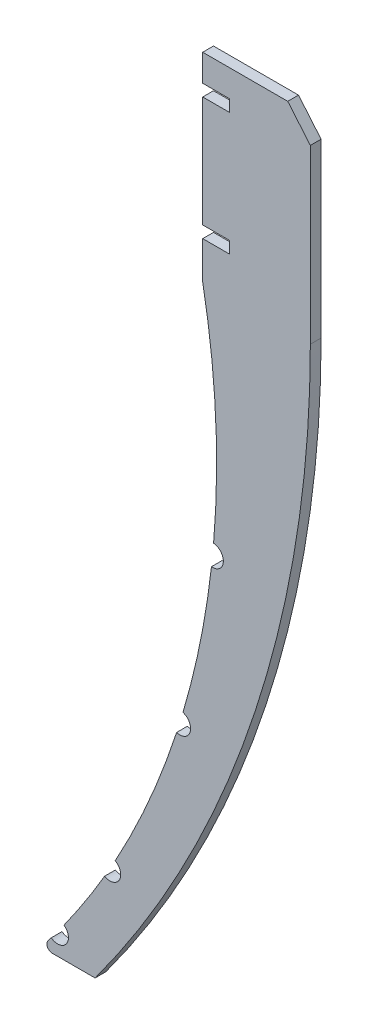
ISO-10303-21;
HEADER;
FILE_DESCRIPTION(('STEP AP214'),'2;1');
FILE_NAME('part.step','',(''),(''),'','','');
FILE_SCHEMA(('AUTOMOTIVE_DESIGN { 1 0 10303 214 1 1 1 1 }'));
ENDSEC;
DATA;
#1=APPLICATION_CONTEXT('core data for automotive mechanical design processes');
#2=APPLICATION_PROTOCOL_DEFINITION('international standard','automotive_design',2000,#1);
#3=PRODUCT_CONTEXT('',#1,'mechanical');
#4=PRODUCT('Part','Part','',(#3));
#5=PRODUCT_RELATED_PRODUCT_CATEGORY('part','',(#4));
#6=PRODUCT_DEFINITION_FORMATION('','',#4);
#7=PRODUCT_DEFINITION_CONTEXT('part definition',#1,'design');
#8=PRODUCT_DEFINITION('design','',#6,#7);
#9=PRODUCT_DEFINITION_SHAPE('','',#8);
#10=(LENGTH_UNIT() NAMED_UNIT(*) SI_UNIT(.MILLI.,.METRE.));
#11=(NAMED_UNIT(*) PLANE_ANGLE_UNIT() SI_UNIT($,.RADIAN.));
#12=(NAMED_UNIT(*) SI_UNIT($,.STERADIAN.) SOLID_ANGLE_UNIT());
#13=UNCERTAINTY_MEASURE_WITH_UNIT(LENGTH_MEASURE(1.E-05),#10,'distance_accuracy_value','');
#14=(GEOMETRIC_REPRESENTATION_CONTEXT(3) GLOBAL_UNCERTAINTY_ASSIGNED_CONTEXT((#13)) GLOBAL_UNIT_ASSIGNED_CONTEXT((#10,
#11,#12)) REPRESENTATION_CONTEXT('',''));
#15=CARTESIAN_POINT('',(0.,0.,0.));
#16=DIRECTION('',(0.,0.,1.));
#17=DIRECTION('',(1.,0.,0.));
#18=AXIS2_PLACEMENT_3D('',#15,#16,#17);
#19=CARTESIAN_POINT('',(-19.9999999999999,-156.8,1.5));
#20=DIRECTION('',(0.,1.,0.));
#21=DIRECTION('',(1.,0.,0.));
#22=AXIS2_PLACEMENT_3D('',#19,#20,#21);
#23=PLANE('',#22);
#24=DIRECTION('',(0.,0.,1.));
#25=VECTOR('',#24,1.);
#26=CARTESIAN_POINT('',(-27.9577727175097,-156.8,1.5));
#27=LINE('',#26,#25);
#28=CARTESIAN_POINT('',(-27.9577727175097,-156.8,-0.5));
#29=VERTEX_POINT('',#28);
#30=CARTESIAN_POINT('',(-27.9577727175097,-156.8,1.5));
#31=VERTEX_POINT('',#30);
#32=EDGE_CURVE('E11',#29,#31,#27,.T.);
#33=ORIENTED_EDGE('',*,*,#32,.F.);
#34=DIRECTION('',(-1.,0.,0.));
#35=VECTOR('',#34,1.);
#36=CARTESIAN_POINT('',(-186.05,-156.8,-0.5));
#37=LINE('',#36,#35);
#38=CARTESIAN_POINT('',(-19.9999999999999,-156.8,-0.5));
#39=VERTEX_POINT('',#38);
#40=EDGE_CURVE('E149',#29,#39,#37,.F.);
#41=ORIENTED_EDGE('',*,*,#40,.T.);
#42=DIRECTION('',(0.,0.,1.));
#43=VECTOR('',#42,1.);
#44=CARTESIAN_POINT('',(-19.9999999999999,-156.8,1.5));
#45=LINE('',#44,#43);
#46=CARTESIAN_POINT('',(-19.9999999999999,-156.8,1.5));
#47=VERTEX_POINT('',#46);
#48=EDGE_CURVE('E44',#39,#47,#45,.T.);
#49=ORIENTED_EDGE('',*,*,#48,.T.);
#50=DIRECTION('',(1.,0.,0.));
#51=VECTOR('',#50,1.);
#52=CARTESIAN_POINT('',(-19.9999999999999,-156.8,1.5));
#53=LINE('',#52,#51);
#54=EDGE_CURVE('E284',#31,#47,#53,.T.);
#55=ORIENTED_EDGE('',*,*,#54,.F.);
#56=EDGE_LOOP('',(#33,#41,#49,#55));
#57=FACE_BOUND('',#56,.T.);
#58=ADVANCED_FACE('F34',(#57),#23,.F.);
#59=CARTESIAN_POINT('',(-186.05,-34.8000000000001,1.5));
#60=DIRECTION('',(0.,0.,1.));
#61=DIRECTION('',(1.,0.,0.));
#62=AXIS2_PLACEMENT_3D('',#59,#60,#61);
#63=CYLINDRICAL_SURFACE('',#62,206.05);
#64=ORIENTED_EDGE('',*,*,#48,.F.);
#65=CARTESIAN_POINT('',(-186.05,-34.8000000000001,-0.5));
#66=DIRECTION('',(0.,0.,1.));
#67=DIRECTION('',(1.,0.,0.));
#68=AXIS2_PLACEMENT_3D('',#65,#66,#67);
#69=CIRCLE('',#68,206.05);
#70=CARTESIAN_POINT('',(20.,-34.8,-0.5));
#71=VERTEX_POINT('',#70);
#72=EDGE_CURVE('E216',#39,#71,#69,.T.);
#73=ORIENTED_EDGE('',*,*,#72,.T.);
#74=DIRECTION('',(0.,0.,1.));
#75=VECTOR('',#74,1.);
#76=CARTESIAN_POINT('',(20.,-34.8,1.5));
#77=LINE('',#76,#75);
#78=CARTESIAN_POINT('',(20.,-34.8,1.5));
#79=VERTEX_POINT('',#78);
#80=EDGE_CURVE('E277',#71,#79,#77,.T.);
#81=ORIENTED_EDGE('',*,*,#80,.T.);
#82=CARTESIAN_POINT('',(-186.05,-34.8000000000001,1.5));
#83=DIRECTION('',(0.,0.,1.));
#84=DIRECTION('',(-1.,0.,0.));
#85=AXIS2_PLACEMENT_3D('',#82,#83,#84);
#86=CIRCLE('',#85,206.05);
#87=EDGE_CURVE('E293',#47,#79,#86,.T.);
#88=ORIENTED_EDGE('',*,*,#87,.F.);
#89=EDGE_LOOP('',(#64,#73,#81,#88));
#90=FACE_BOUND('',#89,.T.);
#91=ADVANCED_FACE('F296',(#90),#63,.T.);
#92=CARTESIAN_POINT('',(20.,2.2,1.5));
#93=DIRECTION('',(-1.,0.,0.));
#94=DIRECTION('',(0.,1.,0.));
#95=AXIS2_PLACEMENT_3D('',#92,#93,#94);
#96=PLANE('',#95);
#97=ORIENTED_EDGE('',*,*,#80,.F.);
#98=DIRECTION('',(0.,1.,0.));
#99=VECTOR('',#98,1.);
#100=CARTESIAN_POINT('',(20.,-34.8000000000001,-0.5));
#101=LINE('',#100,#99);
#102=CARTESIAN_POINT('',(20.,-2.80000000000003,-0.5));
#103=VERTEX_POINT('',#102);
#104=EDGE_CURVE('E213',#71,#103,#101,.T.);
#105=ORIENTED_EDGE('',*,*,#104,.T.);
#106=DIRECTION('',(0.,0.,1.));
#107=VECTOR('',#106,1.);
#108=CARTESIAN_POINT('',(20.,-2.80000000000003,1.5));
#109=LINE('',#108,#107);
#110=CARTESIAN_POINT('',(20.,-2.80000000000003,1.5));
#111=VERTEX_POINT('',#110);
#112=EDGE_CURVE('E274',#103,#111,#109,.T.);
#113=ORIENTED_EDGE('',*,*,#112,.T.);
#114=DIRECTION('',(0.,1.,0.));
#115=VECTOR('',#114,1.);
#116=CARTESIAN_POINT('',(20.,2.2,1.5));
#117=LINE('',#116,#115);
#118=EDGE_CURVE('E297',#79,#111,#117,.T.);
#119=ORIENTED_EDGE('',*,*,#118,.F.);
#120=EDGE_LOOP('',(#97,#105,#113,#119));
#121=FACE_BOUND('',#120,.T.);
#122=ADVANCED_FACE('F464',(#121),#96,.F.);
#123=CARTESIAN_POINT('',(15.8045018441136,2.2,1.5));
#124=DIRECTION('',(0.76604444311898,0.642787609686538,0.));
#125=DIRECTION('',(0.642787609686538,-0.76604444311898,0.));
#126=AXIS2_PLACEMENT_3D('',#123,#124,#125);
#127=PLANE('',#126);
#128=ORIENTED_EDGE('',*,*,#112,.F.);
#129=DIRECTION('',(0.642787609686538,-0.76604444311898,0.));
#130=VECTOR('',#129,1.);
#131=CARTESIAN_POINT('',(15.8045018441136,2.2,-0.5));
#132=LINE('',#131,#130);
#133=CARTESIAN_POINT('',(15.8045018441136,2.2,-0.5));
#134=VERTEX_POINT('',#133);
#135=EDGE_CURVE('E210',#103,#134,#132,.F.);
#136=ORIENTED_EDGE('',*,*,#135,.T.);
#137=DIRECTION('',(0.,0.,1.));
#138=VECTOR('',#137,1.);
#139=CARTESIAN_POINT('',(15.8045018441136,2.2,1.5));
#140=LINE('',#139,#138);
#141=CARTESIAN_POINT('',(15.8045018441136,2.2,1.5));
#142=VERTEX_POINT('',#141);
#143=EDGE_CURVE('E271',#134,#142,#140,.T.);
#144=ORIENTED_EDGE('',*,*,#143,.T.);
#145=DIRECTION('',(0.642787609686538,-0.76604444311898,0.));
#146=VECTOR('',#145,1.);
#147=CARTESIAN_POINT('',(15.8045018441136,2.2,1.5));
#148=LINE('',#147,#146);
#149=EDGE_CURVE('E299',#111,#142,#148,.F.);
#150=ORIENTED_EDGE('',*,*,#149,.F.);
#151=EDGE_LOOP('',(#128,#136,#144,#150));
#152=FACE_BOUND('',#151,.T.);
#153=ADVANCED_FACE('F460',(#152),#127,.T.);
#154=CARTESIAN_POINT('',(0.,2.2,1.5));
#155=DIRECTION('',(0.,-1.,0.));
#156=DIRECTION('',(-1.,0.,0.));
#157=AXIS2_PLACEMENT_3D('',#154,#155,#156);
#158=PLANE('',#157);
#159=ORIENTED_EDGE('',*,*,#143,.F.);
#160=DIRECTION('',(-1.,0.,0.));
#161=VECTOR('',#160,1.);
#162=CARTESIAN_POINT('',(-186.05,2.2,-0.5));
#163=LINE('',#162,#161);
#164=CARTESIAN_POINT('',(0.,2.2,-0.5));
#165=VERTEX_POINT('',#164);
#166=EDGE_CURVE('E207',#134,#165,#163,.T.);
#167=ORIENTED_EDGE('',*,*,#166,.T.);
#168=DIRECTION('',(0.,0.,1.));
#169=VECTOR('',#168,1.);
#170=CARTESIAN_POINT('',(0.,2.2,1.5));
#171=LINE('',#170,#169);
#172=CARTESIAN_POINT('',(0.,2.2,1.5));
#173=VERTEX_POINT('',#172);
#174=EDGE_CURVE('E268',#165,#173,#171,.T.);
#175=ORIENTED_EDGE('',*,*,#174,.T.);
#176=DIRECTION('',(-1.,0.,0.));
#177=VECTOR('',#176,1.);
#178=CARTESIAN_POINT('',(0.,2.2,1.5));
#179=LINE('',#178,#177);
#180=EDGE_CURVE('E305',#142,#173,#179,.T.);
#181=ORIENTED_EDGE('',*,*,#180,.F.);
#182=EDGE_LOOP('',(#159,#167,#175,#181));
#183=FACE_BOUND('',#182,.T.);
#184=ADVANCED_FACE('F457',(#183),#158,.F.);
#185=CARTESIAN_POINT('',(0.,-2.8,1.5));
#186=DIRECTION('',(1.,0.,0.));
#187=DIRECTION('',(0.,-1.,0.));
#188=AXIS2_PLACEMENT_3D('',#185,#186,#187);
#189=PLANE('',#188);
#190=ORIENTED_EDGE('',*,*,#174,.F.);
#191=DIRECTION('',(0.,1.,0.));
#192=VECTOR('',#191,1.);
#193=CARTESIAN_POINT('',(0.,-34.8000000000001,-0.5));
#194=LINE('',#193,#192);
#195=CARTESIAN_POINT('',(0.,-2.8,-0.5));
#196=VERTEX_POINT('',#195);
#197=EDGE_CURVE('E204',#165,#196,#194,.F.);
#198=ORIENTED_EDGE('',*,*,#197,.T.);
#199=DIRECTION('',(0.,0.,1.));
#200=VECTOR('',#199,1.);
#201=CARTESIAN_POINT('',(0.,-2.8,1.5));
#202=LINE('',#201,#200);
#203=CARTESIAN_POINT('',(0.,-2.8,1.5));
#204=VERTEX_POINT('',#203);
#205=EDGE_CURVE('E265',#196,#204,#202,.T.);
#206=ORIENTED_EDGE('',*,*,#205,.T.);
#207=DIRECTION('',(0.,-1.,0.));
#208=VECTOR('',#207,1.);
#209=CARTESIAN_POINT('',(0.,-2.8,1.5));
#210=LINE('',#209,#208);
#211=EDGE_CURVE('E308',#173,#204,#210,.T.);
#212=ORIENTED_EDGE('',*,*,#211,.F.);
#213=EDGE_LOOP('',(#190,#198,#206,#212));
#214=FACE_BOUND('',#213,.T.);
#215=ADVANCED_FACE('F454',(#214),#189,.F.);
#216=CARTESIAN_POINT('',(0.,-2.8,1.5));
#217=DIRECTION('',(0.,1.,0.));
#218=DIRECTION('',(1.,0.,0.));
#219=AXIS2_PLACEMENT_3D('',#216,#217,#218);
#220=PLANE('',#219);
#221=ORIENTED_EDGE('',*,*,#205,.F.);
#222=DIRECTION('',(-1.,0.,0.));
#223=VECTOR('',#222,1.);
#224=CARTESIAN_POINT('',(-186.05,-2.8,-0.5));
#225=LINE('',#224,#223);
#226=CARTESIAN_POINT('',(5.,-2.8,-0.5));
#227=VERTEX_POINT('',#226);
#228=EDGE_CURVE('E201',#196,#227,#225,.F.);
#229=ORIENTED_EDGE('',*,*,#228,.T.);
#230=DIRECTION('',(0.,0.,1.));
#231=VECTOR('',#230,1.);
#232=CARTESIAN_POINT('',(5.,-2.8,1.5));
#233=LINE('',#232,#231);
#234=CARTESIAN_POINT('',(5.,-2.8,1.5));
#235=VERTEX_POINT('',#234);
#236=EDGE_CURVE('E262',#227,#235,#233,.T.);
#237=ORIENTED_EDGE('',*,*,#236,.T.);
#238=DIRECTION('',(1.,0.,0.));
#239=VECTOR('',#238,1.);
#240=CARTESIAN_POINT('',(0.,-2.8,1.5));
#241=LINE('',#240,#239);
#242=EDGE_CURVE('E311',#204,#235,#241,.T.);
#243=ORIENTED_EDGE('',*,*,#242,.F.);
#244=EDGE_LOOP('',(#221,#229,#237,#243));
#245=FACE_BOUND('',#244,.T.);
#246=ADVANCED_FACE('F449',(#245),#220,.F.);
#247=CARTESIAN_POINT('',(5.,-2.8,1.5));
#248=DIRECTION('',(1.,0.,0.));
#249=DIRECTION('',(0.,-1.,0.));
#250=AXIS2_PLACEMENT_3D('',#247,#248,#249);
#251=PLANE('',#250);
#252=ORIENTED_EDGE('',*,*,#236,.F.);
#253=DIRECTION('',(0.,1.,0.));
#254=VECTOR('',#253,1.);
#255=CARTESIAN_POINT('',(5.,-34.8000000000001,-0.5));
#256=LINE('',#255,#254);
#257=CARTESIAN_POINT('',(5.,-5.,-0.5));
#258=VERTEX_POINT('',#257);
#259=EDGE_CURVE('E198',#227,#258,#256,.F.);
#260=ORIENTED_EDGE('',*,*,#259,.T.);
#261=DIRECTION('',(0.,0.,1.));
#262=VECTOR('',#261,1.);
#263=CARTESIAN_POINT('',(5.,-5.,1.5));
#264=LINE('',#263,#262);
#265=CARTESIAN_POINT('',(5.,-5.,1.5));
#266=VERTEX_POINT('',#265);
#267=EDGE_CURVE('E259',#258,#266,#264,.T.);
#268=ORIENTED_EDGE('',*,*,#267,.T.);
#269=DIRECTION('',(0.,-1.,0.));
#270=VECTOR('',#269,1.);
#271=CARTESIAN_POINT('',(5.,-2.8,1.5));
#272=LINE('',#271,#270);
#273=EDGE_CURVE('E314',#235,#266,#272,.T.);
#274=ORIENTED_EDGE('',*,*,#273,.F.);
#275=EDGE_LOOP('',(#252,#260,#268,#274));
#276=FACE_BOUND('',#275,.T.);
#277=ADVANCED_FACE('F445',(#276),#251,.F.);
#278=CARTESIAN_POINT('',(0.,-5.,1.5));
#279=DIRECTION('',(0.,-1.,0.));
#280=DIRECTION('',(-1.,0.,0.));
#281=AXIS2_PLACEMENT_3D('',#278,#279,#280);
#282=PLANE('',#281);
#283=ORIENTED_EDGE('',*,*,#267,.F.);
#284=DIRECTION('',(-1.,0.,0.));
#285=VECTOR('',#284,1.);
#286=CARTESIAN_POINT('',(-186.05,-5.,-0.5));
#287=LINE('',#286,#285);
#288=CARTESIAN_POINT('',(0.,-5.,-0.5));
#289=VERTEX_POINT('',#288);
#290=EDGE_CURVE('E195',#258,#289,#287,.T.);
#291=ORIENTED_EDGE('',*,*,#290,.T.);
#292=DIRECTION('',(0.,0.,1.));
#293=VECTOR('',#292,1.);
#294=CARTESIAN_POINT('',(0.,-5.,1.5));
#295=LINE('',#294,#293);
#296=CARTESIAN_POINT('',(0.,-5.,1.5));
#297=VERTEX_POINT('',#296);
#298=EDGE_CURVE('E256',#289,#297,#295,.T.);
#299=ORIENTED_EDGE('',*,*,#298,.T.);
#300=DIRECTION('',(-1.,0.,0.));
#301=VECTOR('',#300,1.);
#302=CARTESIAN_POINT('',(0.,-5.,1.5));
#303=LINE('',#302,#301);
#304=EDGE_CURVE('E317',#266,#297,#303,.T.);
#305=ORIENTED_EDGE('',*,*,#304,.F.);
#306=EDGE_LOOP('',(#283,#291,#299,#305));
#307=FACE_BOUND('',#306,.T.);
#308=ADVANCED_FACE('F442',(#307),#282,.F.);
#309=CARTESIAN_POINT('',(0.,-5.,1.5));
#310=DIRECTION('',(1.,0.,0.));
#311=DIRECTION('',(0.,-1.,0.));
#312=AXIS2_PLACEMENT_3D('',#309,#310,#311);
#313=PLANE('',#312);
#314=ORIENTED_EDGE('',*,*,#298,.F.);
#315=DIRECTION('',(0.,1.,0.));
#316=VECTOR('',#315,1.);
#317=CARTESIAN_POINT('',(0.,-34.8000000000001,-0.5));
#318=LINE('',#317,#316);
#319=CARTESIAN_POINT('',(0.,-25.6,-0.5));
#320=VERTEX_POINT('',#319);
#321=EDGE_CURVE('E192',#289,#320,#318,.F.);
#322=ORIENTED_EDGE('',*,*,#321,.T.);
#323=DIRECTION('',(0.,0.,1.));
#324=VECTOR('',#323,1.);
#325=CARTESIAN_POINT('',(0.,-25.6,1.5));
#326=LINE('',#325,#324);
#327=CARTESIAN_POINT('',(0.,-25.6,1.5));
#328=VERTEX_POINT('',#327);
#329=EDGE_CURVE('E253',#320,#328,#326,.T.);
#330=ORIENTED_EDGE('',*,*,#329,.T.);
#331=DIRECTION('',(0.,-1.,0.));
#332=VECTOR('',#331,1.);
#333=CARTESIAN_POINT('',(0.,-5.,1.5));
#334=LINE('',#333,#332);
#335=EDGE_CURVE('E320',#297,#328,#334,.T.);
#336=ORIENTED_EDGE('',*,*,#335,.F.);
#337=EDGE_LOOP('',(#314,#322,#330,#336));
#338=FACE_BOUND('',#337,.T.);
#339=ADVANCED_FACE('F437',(#338),#313,.F.);
#340=CARTESIAN_POINT('',(0.,-25.6,1.5));
#341=DIRECTION('',(0.,1.,0.));
#342=DIRECTION('',(1.,0.,0.));
#343=AXIS2_PLACEMENT_3D('',#340,#341,#342);
#344=PLANE('',#343);
#345=ORIENTED_EDGE('',*,*,#329,.F.);
#346=DIRECTION('',(-1.,0.,0.));
#347=VECTOR('',#346,1.);
#348=CARTESIAN_POINT('',(-186.05,-25.6,-0.5));
#349=LINE('',#348,#347);
#350=CARTESIAN_POINT('',(5.,-25.6,-0.5));
#351=VERTEX_POINT('',#350);
#352=EDGE_CURVE('E189',#320,#351,#349,.F.);
#353=ORIENTED_EDGE('',*,*,#352,.T.);
#354=DIRECTION('',(0.,0.,1.));
#355=VECTOR('',#354,1.);
#356=CARTESIAN_POINT('',(5.,-25.6,1.5));
#357=LINE('',#356,#355);
#358=CARTESIAN_POINT('',(5.,-25.6,1.5));
#359=VERTEX_POINT('',#358);
#360=EDGE_CURVE('E250',#351,#359,#357,.T.);
#361=ORIENTED_EDGE('',*,*,#360,.T.);
#362=DIRECTION('',(1.,0.,0.));
#363=VECTOR('',#362,1.);
#364=CARTESIAN_POINT('',(0.,-25.6,1.5));
#365=LINE('',#364,#363);
#366=EDGE_CURVE('E323',#328,#359,#365,.T.);
#367=ORIENTED_EDGE('',*,*,#366,.F.);
#368=EDGE_LOOP('',(#345,#353,#361,#367));
#369=FACE_BOUND('',#368,.T.);
#370=ADVANCED_FACE('F433',(#369),#344,.F.);
#371=CARTESIAN_POINT('',(5.,-25.6,1.5));
#372=DIRECTION('',(1.,0.,0.));
#373=DIRECTION('',(0.,-1.,0.));
#374=AXIS2_PLACEMENT_3D('',#371,#372,#373);
#375=PLANE('',#374);
#376=ORIENTED_EDGE('',*,*,#360,.F.);
#377=DIRECTION('',(0.,1.,0.));
#378=VECTOR('',#377,1.);
#379=CARTESIAN_POINT('',(5.,-34.8000000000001,-0.5));
#380=LINE('',#379,#378);
#381=CARTESIAN_POINT('',(5.,-27.8,-0.5));
#382=VERTEX_POINT('',#381);
#383=EDGE_CURVE('E186',#351,#382,#380,.F.);
#384=ORIENTED_EDGE('',*,*,#383,.T.);
#385=DIRECTION('',(0.,0.,1.));
#386=VECTOR('',#385,1.);
#387=CARTESIAN_POINT('',(5.,-27.8,1.5));
#388=LINE('',#387,#386);
#389=CARTESIAN_POINT('',(5.,-27.8,1.5));
#390=VERTEX_POINT('',#389);
#391=EDGE_CURVE('E247',#382,#390,#388,.T.);
#392=ORIENTED_EDGE('',*,*,#391,.T.);
#393=DIRECTION('',(0.,-1.,0.));
#394=VECTOR('',#393,1.);
#395=CARTESIAN_POINT('',(5.,-25.6,1.5));
#396=LINE('',#395,#394);
#397=EDGE_CURVE('E326',#359,#390,#396,.T.);
#398=ORIENTED_EDGE('',*,*,#397,.F.);
#399=EDGE_LOOP('',(#376,#384,#392,#398));
#400=FACE_BOUND('',#399,.T.);
#401=ADVANCED_FACE('F430',(#400),#375,.F.);
#402=CARTESIAN_POINT('',(0.,-27.8,1.5));
#403=DIRECTION('',(0.,-1.,0.));
#404=DIRECTION('',(-1.,0.,0.));
#405=AXIS2_PLACEMENT_3D('',#402,#403,#404);
#406=PLANE('',#405);
#407=ORIENTED_EDGE('',*,*,#391,.F.);
#408=DIRECTION('',(-1.,0.,0.));
#409=VECTOR('',#408,1.);
#410=CARTESIAN_POINT('',(-186.05,-27.8,-0.5));
#411=LINE('',#410,#409);
#412=CARTESIAN_POINT('',(0.,-27.8,-0.5));
#413=VERTEX_POINT('',#412);
#414=EDGE_CURVE('E183',#382,#413,#411,.T.);
#415=ORIENTED_EDGE('',*,*,#414,.T.);
#416=DIRECTION('',(0.,0.,1.));
#417=VECTOR('',#416,1.);
#418=CARTESIAN_POINT('',(0.,-27.8,1.5));
#419=LINE('',#418,#417);
#420=CARTESIAN_POINT('',(0.,-27.8,1.5));
#421=VERTEX_POINT('',#420);
#422=EDGE_CURVE('E244',#413,#421,#419,.T.);
#423=ORIENTED_EDGE('',*,*,#422,.T.);
#424=DIRECTION('',(-1.,0.,0.));
#425=VECTOR('',#424,1.);
#426=CARTESIAN_POINT('',(0.,-27.8,1.5));
#427=LINE('',#426,#425);
#428=EDGE_CURVE('E329',#390,#421,#427,.T.);
#429=ORIENTED_EDGE('',*,*,#428,.F.);
#430=EDGE_LOOP('',(#407,#415,#423,#429));
#431=FACE_BOUND('',#430,.T.);
#432=ADVANCED_FACE('F425',(#431),#406,.F.);
#433=CARTESIAN_POINT('',(0.,-27.8,1.5));
#434=DIRECTION('',(1.,0.,0.));
#435=DIRECTION('',(0.,-1.,0.));
#436=AXIS2_PLACEMENT_3D('',#433,#434,#435);
#437=PLANE('',#436);
#438=ORIENTED_EDGE('',*,*,#422,.F.);
#439=DIRECTION('',(0.,1.,0.));
#440=VECTOR('',#439,1.);
#441=CARTESIAN_POINT('',(0.,-34.8000000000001,-0.5));
#442=LINE('',#441,#440);
#443=CARTESIAN_POINT('',(0.,-34.8,-0.5));
#444=VERTEX_POINT('',#443);
#445=EDGE_CURVE('E180',#413,#444,#442,.F.);
#446=ORIENTED_EDGE('',*,*,#445,.T.);
#447=DIRECTION('',(0.,0.,1.));
#448=VECTOR('',#447,1.);
#449=CARTESIAN_POINT('',(0.,-34.8,1.5));
#450=LINE('',#449,#448);
#451=CARTESIAN_POINT('',(0.,-34.8,1.5));
#452=VERTEX_POINT('',#451);
#453=EDGE_CURVE('E241',#444,#452,#450,.T.);
#454=ORIENTED_EDGE('',*,*,#453,.T.);
#455=DIRECTION('',(0.,-1.,0.));
#456=VECTOR('',#455,1.);
#457=CARTESIAN_POINT('',(0.,-27.8,1.5));
#458=LINE('',#457,#456);
#459=EDGE_CURVE('E332',#421,#452,#458,.T.);
#460=ORIENTED_EDGE('',*,*,#459,.F.);
#461=EDGE_LOOP('',(#438,#446,#454,#460));
#462=FACE_BOUND('',#461,.T.);
#463=ADVANCED_FACE('F421',(#462),#437,.F.);
#464=CARTESIAN_POINT('',(-149.53282032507,-62.7181589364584,1.5));
#465=DIRECTION('',(0.,0.,-1.));
#466=DIRECTION('',(-1.,0.,0.));
#467=AXIS2_PLACEMENT_3D('',#464,#465,#466);
#468=CYLINDRICAL_SURFACE('',#467,152.11669189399);
#469=ORIENTED_EDGE('',*,*,#453,.F.);
#470=CARTESIAN_POINT('',(-149.53282032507,-62.7181589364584,-0.5));
#471=DIRECTION('',(0.,0.,-1.));
#472=DIRECTION('',(-1.,0.,0.));
#473=AXIS2_PLACEMENT_3D('',#470,#471,#472);
#474=CIRCLE('',#473,152.11669189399);
#475=CARTESIAN_POINT('',(2.01957480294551,-75.8085937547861,-0.5));
#476=VERTEX_POINT('',#475);
#477=EDGE_CURVE('E177',#444,#476,#474,.T.);
#478=ORIENTED_EDGE('',*,*,#477,.T.);
#479=DIRECTION('',(0.,0.,1.));
#480=VECTOR('',#479,1.);
#481=CARTESIAN_POINT('',(2.01957480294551,-75.8085937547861,1.5));
#482=LINE('',#481,#480);
#483=CARTESIAN_POINT('',(2.01957480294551,-75.8085937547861,1.5));
#484=VERTEX_POINT('',#483);
#485=EDGE_CURVE('E238',#476,#484,#482,.T.);
#486=ORIENTED_EDGE('',*,*,#485,.T.);
#487=CARTESIAN_POINT('',(-149.53282032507,-62.7181589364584,1.5));
#488=DIRECTION('',(0.,0.,-1.));
#489=DIRECTION('',(-1.,0.,0.));
#490=AXIS2_PLACEMENT_3D('',#487,#488,#489);
#491=CIRCLE('',#490,152.11669189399);
#492=EDGE_CURVE('E335',#452,#484,#491,.T.);
#493=ORIENTED_EDGE('',*,*,#492,.F.);
#494=EDGE_LOOP('',(#469,#478,#486,#493));
#495=FACE_BOUND('',#494,.T.);
#496=ADVANCED_FACE('F418',(#495),#468,.F.);
#497=CARTESIAN_POINT('',(1.83436906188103,-77.8,1.5));
#498=DIRECTION('',(0.,0.,1.));
#499=DIRECTION('',(1.,0.,0.));
#500=AXIS2_PLACEMENT_3D('',#497,#498,#499);
#501=CYLINDRICAL_SURFACE('',#500,2.);
#502=ORIENTED_EDGE('',*,*,#485,.F.);
#503=CARTESIAN_POINT('',(1.83436906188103,-77.8,-0.5));
#504=DIRECTION('',(0.,0.,1.));
#505=DIRECTION('',(1.,0.,0.));
#506=AXIS2_PLACEMENT_3D('',#503,#504,#505);
#507=CIRCLE('',#506,2.);
#508=CARTESIAN_POINT('',(1.62299728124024,-79.7887991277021,-0.5));
#509=VERTEX_POINT('',#508);
#510=EDGE_CURVE('E174',#509,#476,#507,.T.);
#511=ORIENTED_EDGE('',*,*,#510,.F.);
#512=DIRECTION('',(0.,0.,1.));
#513=VECTOR('',#512,1.);
#514=CARTESIAN_POINT('',(1.62299728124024,-79.7887991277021,1.5));
#515=LINE('',#514,#513);
#516=CARTESIAN_POINT('',(1.62299728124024,-79.7887991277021,1.5));
#517=VERTEX_POINT('',#516);
#518=EDGE_CURVE('E235',#509,#517,#515,.T.);
#519=ORIENTED_EDGE('',*,*,#518,.T.);
#520=CARTESIAN_POINT('',(1.83436906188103,-77.8,1.5));
#521=DIRECTION('',(0.,0.,1.));
#522=DIRECTION('',(1.,0.,0.));
#523=AXIS2_PLACEMENT_3D('',#520,#521,#522);
#524=CIRCLE('',#523,2.);
#525=EDGE_CURVE('E336',#517,#484,#524,.T.);
#526=ORIENTED_EDGE('',*,*,#525,.T.);
#527=EDGE_LOOP('',(#502,#511,#519,#526));
#528=FACE_BOUND('',#527,.T.);
#529=ADVANCED_FACE('F414',(#528),#501,.F.);
#530=ORIENTED_EDGE('',*,*,#518,.F.);
#531=CARTESIAN_POINT('',(-149.53282032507,-62.7181589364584,-0.5));
#532=DIRECTION('',(0.,0.,-1.));
#533=DIRECTION('',(-1.,0.,0.));
#534=AXIS2_PLACEMENT_3D('',#531,#532,#533);
#535=CIRCLE('',#534,152.11669189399);
#536=CARTESIAN_POINT('',(-3.66978203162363,-105.885994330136,-0.5));
#537=VERTEX_POINT('',#536);
#538=EDGE_CURVE('E171',#509,#537,#535,.T.);
#539=ORIENTED_EDGE('',*,*,#538,.T.);
#540=DIRECTION('',(0.,0.,1.));
#541=VECTOR('',#540,1.);
#542=CARTESIAN_POINT('',(-3.66978203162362,-105.885994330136,1.5));
#543=LINE('',#542,#541);
#544=CARTESIAN_POINT('',(-3.66978203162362,-105.885994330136,1.5));
#545=VERTEX_POINT('',#544);
#546=EDGE_CURVE('E232',#537,#545,#543,.T.);
#547=ORIENTED_EDGE('',*,*,#546,.T.);
#548=EDGE_CURVE('E339',#517,#545,#491,.T.);
#549=ORIENTED_EDGE('',*,*,#548,.F.);
#550=EDGE_LOOP('',(#530,#539,#547,#549));
#551=FACE_BOUND('',#550,.T.);
#552=ADVANCED_FACE('F412',(#551),#468,.F.);
#553=CARTESIAN_POINT('',(-4.24993916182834,-107.8,1.5));
#554=DIRECTION('',(0.,0.,1.));
#555=DIRECTION('',(1.,0.,0.));
#556=AXIS2_PLACEMENT_3D('',#553,#554,#555);
#557=CYLINDRICAL_SURFACE('',#556,2.);
#558=ORIENTED_EDGE('',*,*,#546,.F.);
#559=CARTESIAN_POINT('',(-4.24993916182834,-107.8,-0.5));
#560=DIRECTION('',(0.,0.,1.));
#561=DIRECTION('',(1.,0.,0.));
#562=AXIS2_PLACEMENT_3D('',#559,#560,#561);
#563=CIRCLE('',#562,2.);
#564=CARTESIAN_POINT('',(-4.85521056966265,-109.706212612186,-0.5));
#565=VERTEX_POINT('',#564);
#566=EDGE_CURVE('E168',#565,#537,#563,.T.);
#567=ORIENTED_EDGE('',*,*,#566,.F.);
#568=DIRECTION('',(0.,0.,1.));
#569=VECTOR('',#568,1.);
#570=CARTESIAN_POINT('',(-4.85521056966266,-109.706212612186,1.5));
#571=LINE('',#570,#569);
#572=CARTESIAN_POINT('',(-4.85521056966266,-109.706212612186,1.5));
#573=VERTEX_POINT('',#572);
#574=EDGE_CURVE('E229',#565,#573,#571,.T.);
#575=ORIENTED_EDGE('',*,*,#574,.T.);
#576=CARTESIAN_POINT('',(-4.24993916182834,-107.8,1.5));
#577=DIRECTION('',(0.,0.,1.));
#578=DIRECTION('',(1.,0.,0.));
#579=AXIS2_PLACEMENT_3D('',#576,#577,#578);
#580=CIRCLE('',#579,2.);
#581=EDGE_CURVE('E340',#573,#545,#580,.T.);
#582=ORIENTED_EDGE('',*,*,#581,.T.);
#583=EDGE_LOOP('',(#558,#567,#575,#582));
#584=FACE_BOUND('',#583,.T.);
#585=ADVANCED_FACE('F408',(#584),#557,.F.);
#586=ORIENTED_EDGE('',*,*,#574,.F.);
#587=CARTESIAN_POINT('',(-149.53282032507,-62.7181589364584,-0.5));
#588=DIRECTION('',(0.,0.,-1.));
#589=DIRECTION('',(-1.,0.,0.));
#590=AXIS2_PLACEMENT_3D('',#587,#588,#589);
#591=CIRCLE('',#590,152.11669189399);
#592=CARTESIAN_POINT('',(-16.261215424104,-136.054147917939,-0.5));
#593=VERTEX_POINT('',#592);
#594=EDGE_CURVE('E165',#565,#593,#591,.T.);
#595=ORIENTED_EDGE('',*,*,#594,.T.);
#596=DIRECTION('',(0.,0.,1.));
#597=VECTOR('',#596,1.);
#598=CARTESIAN_POINT('',(-16.261215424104,-136.054147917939,1.5));
#599=LINE('',#598,#597);
#600=CARTESIAN_POINT('',(-16.261215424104,-136.054147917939,1.5));
#601=VERTEX_POINT('',#600);
#602=EDGE_CURVE('E226',#593,#601,#599,.T.);
#603=ORIENTED_EDGE('',*,*,#602,.T.);
#604=EDGE_CURVE('E342',#573,#601,#491,.T.);
#605=ORIENTED_EDGE('',*,*,#604,.F.);
#606=EDGE_LOOP('',(#586,#595,#603,#605));
#607=FACE_BOUND('',#606,.T.);
#608=ADVANCED_FACE('F406',(#607),#468,.F.);
#609=CARTESIAN_POINT('',(-17.2369205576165,-137.8,1.5));
#610=DIRECTION('',(0.,0.,1.));
#611=DIRECTION('',(1.,0.,0.));
#612=AXIS2_PLACEMENT_3D('',#609,#610,#611);
#613=CYLINDRICAL_SURFACE('',#612,2.);
#614=ORIENTED_EDGE('',*,*,#602,.F.);
#615=CARTESIAN_POINT('',(-17.2369205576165,-137.8,-0.5));
#616=DIRECTION('',(0.,0.,1.));
#617=DIRECTION('',(1.,0.,0.));
#618=AXIS2_PLACEMENT_3D('',#615,#616,#617);
#619=CIRCLE('',#618,2.);
#620=CARTESIAN_POINT('',(-18.2354949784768,-139.532873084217,-0.5));
#621=VERTEX_POINT('',#620);
#622=EDGE_CURVE('E162',#621,#593,#619,.T.);
#623=ORIENTED_EDGE('',*,*,#622,.F.);
#624=DIRECTION('',(0.,0.,1.));
#625=VECTOR('',#624,1.);
#626=CARTESIAN_POINT('',(-18.2354949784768,-139.532873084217,1.5));
#627=LINE('',#626,#625);
#628=CARTESIAN_POINT('',(-18.2354949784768,-139.532873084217,1.5));
#629=VERTEX_POINT('',#628);
#630=EDGE_CURVE('E223',#621,#629,#627,.T.);
#631=ORIENTED_EDGE('',*,*,#630,.T.);
#632=CARTESIAN_POINT('',(-17.2369205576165,-137.8,1.5));
#633=DIRECTION('',(0.,0.,1.));
#634=DIRECTION('',(1.,0.,0.));
#635=AXIS2_PLACEMENT_3D('',#632,#633,#634);
#636=CIRCLE('',#635,2.);
#637=EDGE_CURVE('E343',#629,#601,#636,.T.);
#638=ORIENTED_EDGE('',*,*,#637,.T.);
#639=EDGE_LOOP('',(#614,#623,#631,#638));
#640=FACE_BOUND('',#639,.T.);
#641=ADVANCED_FACE('F397',(#640),#613,.F.);
#642=ORIENTED_EDGE('',*,*,#630,.F.);
#643=CARTESIAN_POINT('',(-149.53282032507,-62.7181589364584,-0.5));
#644=DIRECTION('',(0.,0.,-1.));
#645=DIRECTION('',(-1.,0.,0.));
#646=AXIS2_PLACEMENT_3D('',#643,#644,#645);
#647=CIRCLE('',#646,152.11669189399);
#648=CARTESIAN_POINT('',(-25.783575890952,-151.18065073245,-0.5));
#649=VERTEX_POINT('',#648);
#650=EDGE_CURVE('E159',#621,#649,#647,.T.);
#651=ORIENTED_EDGE('',*,*,#650,.T.);
#652=DIRECTION('',(0.,0.,1.));
#653=VECTOR('',#652,1.);
#654=CARTESIAN_POINT('',(-25.783575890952,-151.18065073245,1.5));
#655=LINE('',#654,#653);
#656=CARTESIAN_POINT('',(-25.783575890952,-151.18065073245,1.5));
#657=VERTEX_POINT('',#656);
#658=EDGE_CURVE('E221',#649,#657,#655,.T.);
#659=ORIENTED_EDGE('',*,*,#658,.T.);
#660=EDGE_CURVE('E345',#629,#657,#491,.T.);
#661=ORIENTED_EDGE('',*,*,#660,.F.);
#662=EDGE_LOOP('',(#642,#651,#659,#661));
#663=FACE_BOUND('',#662,.T.);
#664=ADVANCED_FACE('F401',(#663),#468,.F.);
#665=CARTESIAN_POINT('',(-26.9573339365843,-152.8,1.5));
#666=DIRECTION('',(0.,0.,1.));
#667=DIRECTION('',(1.,0.,0.));
#668=AXIS2_PLACEMENT_3D('',#665,#666,#667);
#669=CYLINDRICAL_SURFACE('',#668,2.);
#670=ORIENTED_EDGE('',*,*,#658,.F.);
#671=CARTESIAN_POINT('',(-26.9573339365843,-152.8,-0.5));
#672=DIRECTION('',(0.,0.,1.));
#673=DIRECTION('',(1.,0.,0.));
#674=AXIS2_PLACEMENT_3D('',#671,#672,#673);
#675=CIRCLE('',#674,2.);
#676=CARTESIAN_POINT('',(-28.1522809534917,-154.403777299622,-0.5));
#677=VERTEX_POINT('',#676);
#678=EDGE_CURVE('E156',#677,#649,#675,.T.);
#679=ORIENTED_EDGE('',*,*,#678,.F.);
#680=DIRECTION('',(0.,0.,1.));
#681=VECTOR('',#680,1.);
#682=CARTESIAN_POINT('',(-28.1522809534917,-154.403777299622,1.5));
#683=LINE('',#682,#681);
#684=CARTESIAN_POINT('',(-28.1522809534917,-154.403777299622,1.5));
#685=VERTEX_POINT('',#684);
#686=EDGE_CURVE('E52',#677,#685,#683,.T.);
#687=ORIENTED_EDGE('',*,*,#686,.T.);
#688=CARTESIAN_POINT('',(-26.9573339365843,-152.8,1.5));
#689=DIRECTION('',(0.,0.,1.));
#690=DIRECTION('',(1.,0.,0.));
#691=AXIS2_PLACEMENT_3D('',#688,#689,#690);
#692=CIRCLE('',#691,2.);
#693=EDGE_CURVE('E142',#685,#657,#692,.T.);
#694=ORIENTED_EDGE('',*,*,#693,.T.);
#695=EDGE_LOOP('',(#670,#679,#687,#694));
#696=FACE_BOUND('',#695,.T.);
#697=ADVANCED_FACE('F402',(#696),#669,.F.);
#698=ORIENTED_EDGE('',*,*,#686,.F.);
#699=CARTESIAN_POINT('',(-149.53282032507,-62.7181589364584,-0.5));
#700=DIRECTION('',(0.,0.,-1.));
#701=DIRECTION('',(-1.,0.,0.));
#702=AXIS2_PLACEMENT_3D('',#699,#700,#701);
#703=CIRCLE('',#702,152.11669189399);
#704=CARTESIAN_POINT('',(-28.7517752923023,-155.19208560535,-0.5));
#705=VERTEX_POINT('',#704);
#706=EDGE_CURVE('E147',#677,#705,#703,.T.);
#707=ORIENTED_EDGE('',*,*,#706,.T.);
#708=DIRECTION('',(0.,0.,1.));
#709=VECTOR('',#708,1.);
#710=CARTESIAN_POINT('',(-28.7517752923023,-155.19208560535,1.5));
#711=LINE('',#710,#709);
#712=CARTESIAN_POINT('',(-28.7517752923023,-155.19208560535,1.5));
#713=VERTEX_POINT('',#712);
#714=EDGE_CURVE('E38',#705,#713,#711,.T.);
#715=ORIENTED_EDGE('',*,*,#714,.T.);
#716=EDGE_CURVE('E158',#685,#713,#491,.T.);
#717=ORIENTED_EDGE('',*,*,#716,.F.);
#718=EDGE_LOOP('',(#698,#707,#715,#717));
#719=FACE_BOUND('',#718,.T.);
#720=ADVANCED_FACE('F151',(#719),#468,.F.);
#721=CARTESIAN_POINT('',(-27.9577727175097,-155.8,1.5));
#722=DIRECTION('',(0.,0.,-1.));
#723=DIRECTION('',(-1.,0.,0.));
#724=AXIS2_PLACEMENT_3D('',#721,#722,#723);
#725=CYLINDRICAL_SURFACE('',#724,1.);
#726=CARTESIAN_POINT('',(-27.9577727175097,-155.8,-0.5));
#727=DIRECTION('',(0.,0.,-1.));
#728=DIRECTION('',(-1.,0.,0.));
#729=AXIS2_PLACEMENT_3D('',#726,#727,#728);
#730=CIRCLE('',#729,1.);
#731=EDGE_CURVE('E136',#705,#29,#730,.F.);
#732=ORIENTED_EDGE('',*,*,#731,.T.);
#733=ORIENTED_EDGE('',*,*,#32,.T.);
#734=CARTESIAN_POINT('',(-27.9577727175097,-155.8,1.5));
#735=DIRECTION('',(0.,0.,-1.));
#736=DIRECTION('',(-1.,0.,0.));
#737=AXIS2_PLACEMENT_3D('',#734,#735,#736);
#738=CIRCLE('',#737,1.);
#739=EDGE_CURVE('E138',#713,#31,#738,.F.);
#740=ORIENTED_EDGE('',*,*,#739,.F.);
#741=ORIENTED_EDGE('',*,*,#714,.F.);
#742=EDGE_LOOP('',(#732,#733,#740,#741));
#743=FACE_BOUND('',#742,.T.);
#744=ADVANCED_FACE('F36',(#743),#725,.T.);
#745=CARTESIAN_POINT('',(-186.05,-34.8000000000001,1.5));
#746=DIRECTION('',(0.,0.,-1.));
#747=DIRECTION('',(-1.,0.,0.));
#748=AXIS2_PLACEMENT_3D('',#745,#746,#747);
#749=PLANE('',#748);
#750=ORIENTED_EDGE('',*,*,#716,.T.);
#751=ORIENTED_EDGE('',*,*,#739,.T.);
#752=ORIENTED_EDGE('',*,*,#54,.T.);
#753=ORIENTED_EDGE('',*,*,#87,.T.);
#754=ORIENTED_EDGE('',*,*,#118,.T.);
#755=ORIENTED_EDGE('',*,*,#149,.T.);
#756=ORIENTED_EDGE('',*,*,#180,.T.);
#757=ORIENTED_EDGE('',*,*,#211,.T.);
#758=ORIENTED_EDGE('',*,*,#242,.T.);
#759=ORIENTED_EDGE('',*,*,#273,.T.);
#760=ORIENTED_EDGE('',*,*,#304,.T.);
#761=ORIENTED_EDGE('',*,*,#335,.T.);
#762=ORIENTED_EDGE('',*,*,#366,.T.);
#763=ORIENTED_EDGE('',*,*,#397,.T.);
#764=ORIENTED_EDGE('',*,*,#428,.T.);
#765=ORIENTED_EDGE('',*,*,#459,.T.);
#766=ORIENTED_EDGE('',*,*,#492,.T.);
#767=ORIENTED_EDGE('',*,*,#525,.F.);
#768=ORIENTED_EDGE('',*,*,#548,.T.);
#769=ORIENTED_EDGE('',*,*,#581,.F.);
#770=ORIENTED_EDGE('',*,*,#604,.T.);
#771=ORIENTED_EDGE('',*,*,#637,.F.);
#772=ORIENTED_EDGE('',*,*,#660,.T.);
#773=ORIENTED_EDGE('',*,*,#693,.F.);
#774=EDGE_LOOP('',(#750,#751,#752,#753,#754,#755,#756,#757,#758,#759,#760,#761,#762,#763,#764,
#765,#766,#767,#768,#769,#770,#771,#772,#773));
#775=FACE_BOUND('',#774,.T.);
#776=ADVANCED_FACE('F291',(#775),#749,.F.);
#777=CARTESIAN_POINT('',(-186.05,-34.8000000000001,-0.5));
#778=DIRECTION('',(0.,0.,-1.));
#779=DIRECTION('',(-1.,0.,0.));
#780=AXIS2_PLACEMENT_3D('',#777,#778,#779);
#781=PLANE('',#780);
#782=ORIENTED_EDGE('',*,*,#706,.F.);
#783=ORIENTED_EDGE('',*,*,#678,.T.);
#784=ORIENTED_EDGE('',*,*,#650,.F.);
#785=ORIENTED_EDGE('',*,*,#622,.T.);
#786=ORIENTED_EDGE('',*,*,#594,.F.);
#787=ORIENTED_EDGE('',*,*,#566,.T.);
#788=ORIENTED_EDGE('',*,*,#538,.F.);
#789=ORIENTED_EDGE('',*,*,#510,.T.);
#790=ORIENTED_EDGE('',*,*,#477,.F.);
#791=ORIENTED_EDGE('',*,*,#445,.F.);
#792=ORIENTED_EDGE('',*,*,#414,.F.);
#793=ORIENTED_EDGE('',*,*,#383,.F.);
#794=ORIENTED_EDGE('',*,*,#352,.F.);
#795=ORIENTED_EDGE('',*,*,#321,.F.);
#796=ORIENTED_EDGE('',*,*,#290,.F.);
#797=ORIENTED_EDGE('',*,*,#259,.F.);
#798=ORIENTED_EDGE('',*,*,#228,.F.);
#799=ORIENTED_EDGE('',*,*,#197,.F.);
#800=ORIENTED_EDGE('',*,*,#166,.F.);
#801=ORIENTED_EDGE('',*,*,#135,.F.);
#802=ORIENTED_EDGE('',*,*,#104,.F.);
#803=ORIENTED_EDGE('',*,*,#72,.F.);
#804=ORIENTED_EDGE('',*,*,#40,.F.);
#805=ORIENTED_EDGE('',*,*,#731,.F.);
#806=EDGE_LOOP('',(#782,#783,#784,#785,#786,#787,#788,#789,#790,#791,#792,#793,#794,#795,#796,
#797,#798,#799,#800,#801,#802,#803,#804,#805));
#807=FACE_BOUND('',#806,.T.);
#808=ADVANCED_FACE('F145',(#807),#781,.T.);
#809=CLOSED_SHELL('',(#58,#91,#122,#153,#184,#215,#246,#277,#308,#339,#370,#401,#432,#463,#496,
#529,#552,#585,#608,#641,#664,#697,#720,#744,#776,#808));
#810=MANIFOLD_SOLID_BREP('B2',#809);
#811=ADVANCED_BREP_SHAPE_REPRESENTATION('',(#18,#810),#14);
#812=SHAPE_DEFINITION_REPRESENTATION(#9,#811);
ENDSEC;
END-ISO-10303-21;
